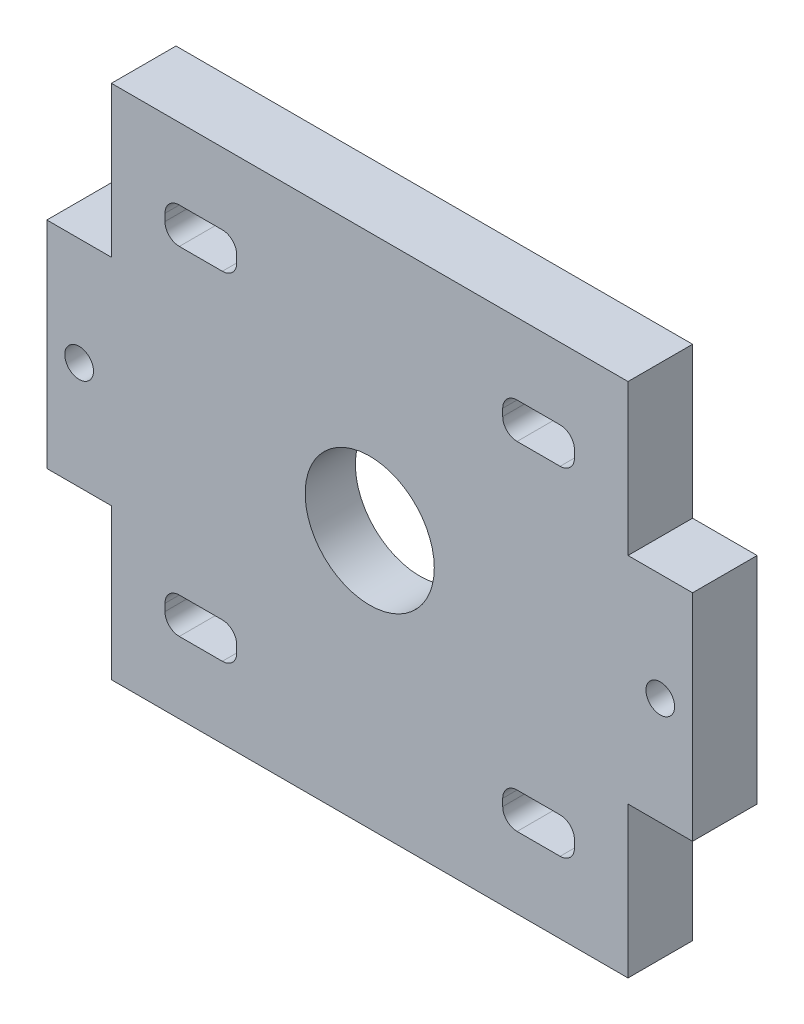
from build123d import *

# Parameters (mm, degrees)
SKETCH_1_R          = 9
EXTRUDE_1_DEPTH     = 9
SKETCH_1_5_R        = 18.65
SKETCH_1_5_R_2      = 9
CUT_EXTRUDE_1_DEPTH = 2
SKETCH_1_7_R        = 2
CUT_EXTRUDE_3_DEPTH = 10


with BuildPart() as part:
    # Sketch 1 → Extrude 1 (new body)
    with BuildSketch(Plane.XY):
        Polygon((22.503050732, 97.166228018), (22.503050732, 118.166228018), (31.503050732, 118.166228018), (31.503050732, 148.166228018), (22.503050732, 148.166228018), (22.503050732, 169.166228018), (-49.496949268, 169.166228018), (-49.496949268, 148.166228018), (-58.496949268, 148.166228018), (-58.496949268, 118.166228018), (-49.496949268, 118.166228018), (-49.496949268, 97.166228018), align=None)
        with Locations((-13.496949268, 133.166228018)):
            Circle(SKETCH_1_R, mode=Mode.SUBTRACT)
        with BuildLine():
            Line((-40.035531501, 159.204810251), (-34.035531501, 159.204810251))
            ThreePointArc((-34.035531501, 159.204810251), (-32.621317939, 158.619023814), (-32.035531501, 157.204810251))
            Line((-32.035531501, 157.204810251), (-32.035531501, 156.204810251))
            ThreePointArc((-32.035531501, 156.204810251), (-32.621317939, 154.790596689), (-34.035531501, 154.204810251))
            Line((-34.035531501, 154.204810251), (-40.035531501, 154.204810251))
            ThreePointArc((-40.035531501, 154.204810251), (-41.449745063, 154.790596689), (-42.035531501, 156.204810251))
            Line((-42.035531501, 156.204810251), (-42.035531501, 157.204810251))
            ThreePointArc((-42.035531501, 157.204810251), (-41.449745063, 158.619023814), (-40.035531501, 159.204810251))
        make_face(mode=Mode.SUBTRACT)
        with BuildLine():
            Line((5.041632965, 157.204810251), (5.041632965, 156.204810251))
            ThreePointArc((5.041632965, 156.204810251), (5.627419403, 154.790596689), (7.041632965, 154.204810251))
            Line((7.041632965, 154.204810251), (13.041632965, 154.204810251))
            ThreePointArc((13.041632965, 154.204810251), (14.455846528, 154.790596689), (15.041632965, 156.204810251))
            Line((15.041632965, 156.204810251), (15.041632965, 157.204810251))
            ThreePointArc((15.041632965, 157.204810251), (14.455846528, 158.619023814), (13.041632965, 159.204810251))
            Line((13.041632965, 159.204810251), (7.041632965, 159.204810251))
            ThreePointArc((7.041632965, 159.204810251), (5.627419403, 158.619023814), (5.041632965, 157.204810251))
        make_face(mode=Mode.SUBTRACT)
        with BuildLine():
            Line((13.041632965, 107.127645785), (7.041632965, 107.127645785))
            ThreePointArc((7.041632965, 107.127645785), (5.627419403, 107.713432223), (5.041632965, 109.127645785))
            Line((5.041632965, 109.127645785), (5.041632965, 110.127645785))
            ThreePointArc((5.041632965, 110.127645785), (5.627419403, 111.541859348), (7.041632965, 112.127645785))
            Line((7.041632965, 112.127645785), (13.041632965, 112.127645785))
            ThreePointArc((13.041632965, 112.127645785), (14.455846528, 111.541859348), (15.041632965, 110.127645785))
            Line((15.041632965, 110.127645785), (15.041632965, 109.127645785))
            ThreePointArc((15.041632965, 109.127645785), (14.455846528, 107.713432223), (13.041632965, 107.127645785))
        make_face(mode=Mode.SUBTRACT)
        with BuildLine():
            Line((-32.035531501, 109.127645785), (-32.035531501, 110.127645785))
            ThreePointArc((-32.035531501, 110.127645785), (-32.621317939, 111.541859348), (-34.035531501, 112.127645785))
            Line((-34.035531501, 112.127645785), (-40.035531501, 112.127645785))
            ThreePointArc((-40.035531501, 112.127645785), (-41.449745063, 111.541859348), (-42.035531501, 110.127645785))
            Line((-42.035531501, 110.127645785), (-42.035531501, 109.127645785))
            ThreePointArc((-42.035531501, 109.127645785), (-41.449745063, 107.713432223), (-40.035531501, 107.127645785))
            Line((-40.035531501, 107.127645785), (-34.035531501, 107.127645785))
            ThreePointArc((-34.035531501, 107.127645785), (-32.621317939, 107.713432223), (-32.035531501, 109.127645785))
        make_face(mode=Mode.SUBTRACT)
    extrude(amount=EXTRUDE_1_DEPTH)

    # Sketch 1_5 → Cut-Extrude 1 (cut)
    with BuildSketch(Plane.XY):
        with Locations((-13.496949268, 133.166228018)):
            Circle(SKETCH_1_5_R)
        with Locations((-13.496949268, 133.166228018)):
            Circle(SKETCH_1_5_R_2, mode=Mode.SUBTRACT)
    extrude(amount=CUT_EXTRUDE_1_DEPTH, mode=Mode.SUBTRACT)

    # Sketch 1_7 → Cut-Extrude 3 (cut)
    with BuildSketch(Plane.XY):
        with Locations(Location((-53.996949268, 133.166228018, 0), (0, 0, 180))):
            Circle(SKETCH_1_7_R)
        with Locations(Location((27.003050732, 133.166228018, 0), (0, 0, 180))):
            Circle(SKETCH_1_7_R)
    extrude(amount=CUT_EXTRUDE_3_DEPTH, mode=Mode.SUBTRACT)


solid = part.part
